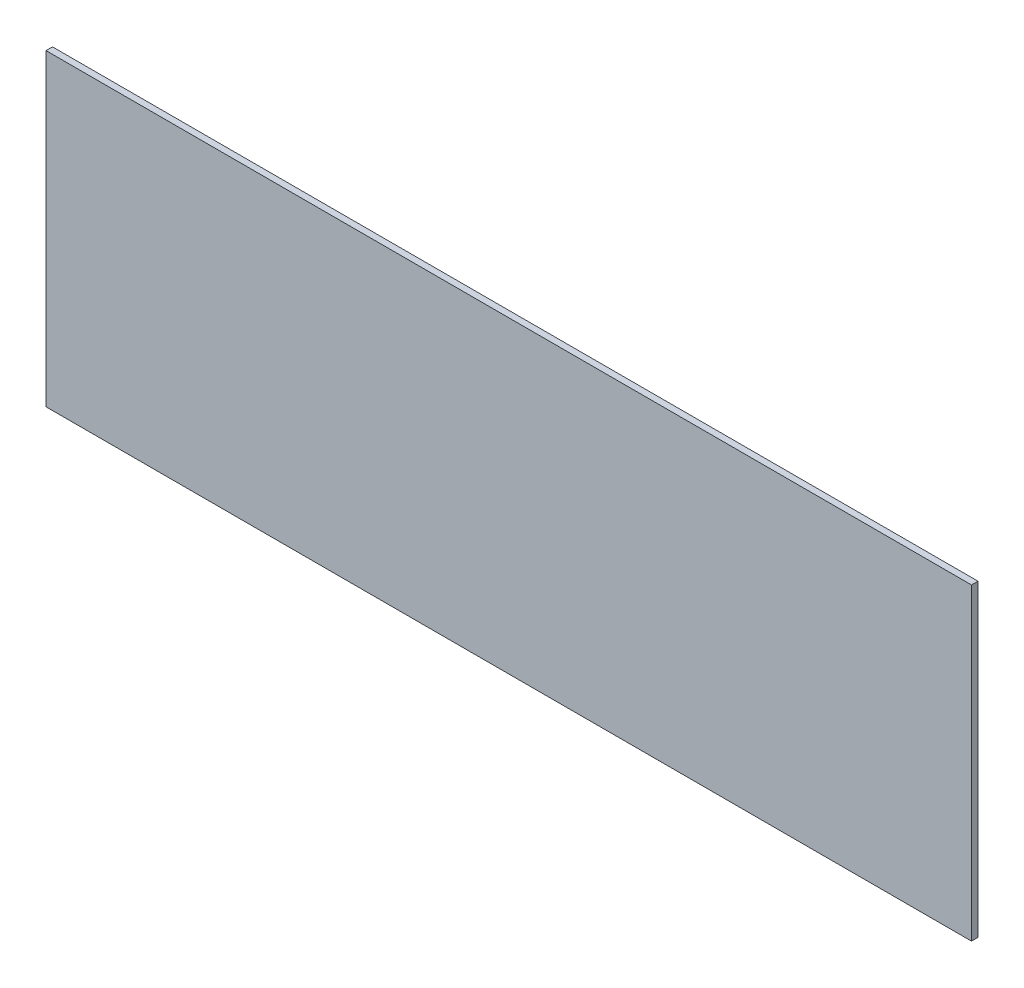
from build123d import *

# Parameters (mm, degrees)
SKETCH1_W      = 228.6
SKETCH1_H      = 76.2
EXTRUDE1_DEPTH = 1.6002


with BuildPart() as part:
    # Sketch1 → Extrude1 (new body)
    with BuildSketch(Plane.XY):
        with Locations((114.3, 38.1)):
            Rectangle(SKETCH1_W, SKETCH1_H)
    extrude(amount=EXTRUDE1_DEPTH)


solid = part.part
